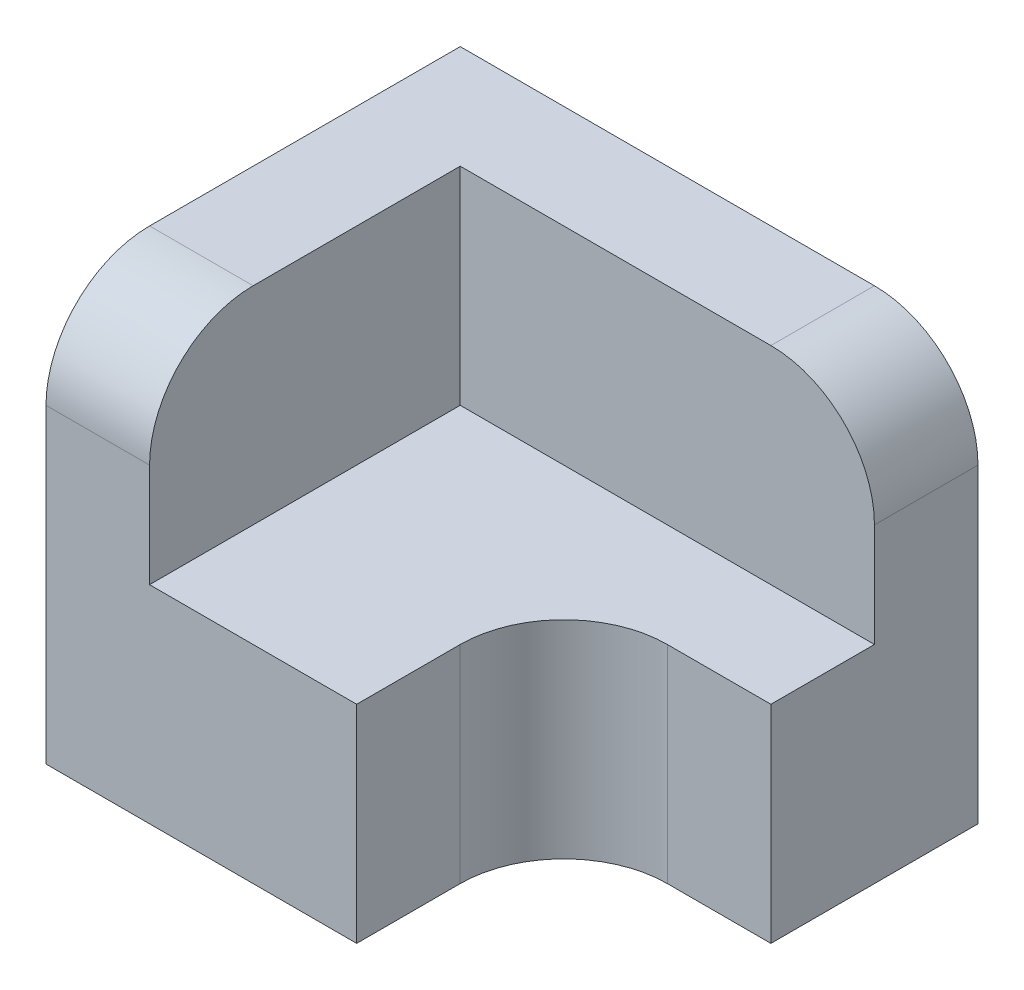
ISO-10303-21;
HEADER;
FILE_DESCRIPTION(('STEP AP214'),'2;1');
FILE_NAME('part.step','',(''),(''),'','','');
FILE_SCHEMA(('AUTOMOTIVE_DESIGN { 1 0 10303 214 1 1 1 1 }'));
ENDSEC;
DATA;
#1=APPLICATION_CONTEXT('core data for automotive mechanical design processes');
#2=APPLICATION_PROTOCOL_DEFINITION('international standard','automotive_design',2000,#1);
#3=PRODUCT_CONTEXT('',#1,'mechanical');
#4=PRODUCT('Part','Part','',(#3));
#5=PRODUCT_RELATED_PRODUCT_CATEGORY('part','',(#4));
#6=PRODUCT_DEFINITION_FORMATION('','',#4);
#7=PRODUCT_DEFINITION_CONTEXT('part definition',#1,'design');
#8=PRODUCT_DEFINITION('design','',#6,#7);
#9=PRODUCT_DEFINITION_SHAPE('','',#8);
#10=(LENGTH_UNIT() NAMED_UNIT(*) SI_UNIT(.MILLI.,.METRE.));
#11=(NAMED_UNIT(*) PLANE_ANGLE_UNIT() SI_UNIT($,.RADIAN.));
#12=(NAMED_UNIT(*) SI_UNIT($,.STERADIAN.) SOLID_ANGLE_UNIT());
#13=UNCERTAINTY_MEASURE_WITH_UNIT(LENGTH_MEASURE(1.E-05),#10,'distance_accuracy_value','');
#14=(GEOMETRIC_REPRESENTATION_CONTEXT(3) GLOBAL_UNCERTAINTY_ASSIGNED_CONTEXT((#13)) GLOBAL_UNIT_ASSIGNED_CONTEXT((#10,
#11,#12)) REPRESENTATION_CONTEXT('',''));
#15=CARTESIAN_POINT('',(0.,0.,0.));
#16=DIRECTION('',(0.,0.,1.));
#17=DIRECTION('',(1.,0.,0.));
#18=AXIS2_PLACEMENT_3D('',#15,#16,#17);
#19=CARTESIAN_POINT('',(0.,20.,0.));
#20=DIRECTION('',(1.,0.,0.));
#21=DIRECTION('',(0.,0.,-1.));
#22=AXIS2_PLACEMENT_3D('',#19,#20,#21);
#23=PLANE('',#22);
#24=DIRECTION('',(0.,-1.,0.));
#25=VECTOR('',#24,1.);
#26=CARTESIAN_POINT('',(0.,20.,0.));
#27=LINE('',#26,#25);
#28=CARTESIAN_POINT('',(0.,30.,0.));
#29=VERTEX_POINT('',#28);
#30=CARTESIAN_POINT('',(0.,0.,0.));
#31=VERTEX_POINT('',#30);
#32=EDGE_CURVE('E201',#29,#31,#27,.T.);
#33=ORIENTED_EDGE('',*,*,#32,.F.);
#34=CARTESIAN_POINT('',(0.,30.,-10.));
#35=DIRECTION('',(1.,0.,0.));
#36=DIRECTION('',(0.,0.,-1.));
#37=AXIS2_PLACEMENT_3D('',#34,#35,#36);
#38=CIRCLE('',#37,10.);
#39=CARTESIAN_POINT('',(0.,40.,-10.));
#40=VERTEX_POINT('',#39);
#41=EDGE_CURVE('E45',#29,#40,#38,.F.);
#42=ORIENTED_EDGE('',*,*,#41,.T.);
#43=DIRECTION('',(0.,0.,1.));
#44=VECTOR('',#43,1.);
#45=CARTESIAN_POINT('',(0.,40.,-40.));
#46=LINE('',#45,#44);
#47=CARTESIAN_POINT('',(0.,40.,-40.));
#48=VERTEX_POINT('',#47);
#49=EDGE_CURVE('E143',#48,#40,#46,.T.);
#50=ORIENTED_EDGE('',*,*,#49,.F.);
#51=DIRECTION('',(0.,-1.,0.));
#52=VECTOR('',#51,1.);
#53=CARTESIAN_POINT('',(0.,20.,-40.));
#54=LINE('',#53,#52);
#55=CARTESIAN_POINT('',(0.,0.,-40.));
#56=VERTEX_POINT('',#55);
#57=EDGE_CURVE('E224',#48,#56,#54,.T.);
#58=ORIENTED_EDGE('',*,*,#57,.T.);
#59=DIRECTION('',(0.,0.,1.));
#60=VECTOR('',#59,1.);
#61=CARTESIAN_POINT('',(0.,0.,0.));
#62=LINE('',#61,#60);
#63=EDGE_CURVE('E164',#56,#31,#62,.T.);
#64=ORIENTED_EDGE('',*,*,#63,.T.);
#65=EDGE_LOOP('',(#33,#42,#50,#58,#64));
#66=FACE_BOUND('',#65,.T.);
#67=ADVANCED_FACE('F30',(#66),#23,.F.);
#68=CARTESIAN_POINT('',(0.,20.,0.));
#69=DIRECTION('',(0.,0.,-1.));
#70=DIRECTION('',(-1.,0.,0.));
#71=AXIS2_PLACEMENT_3D('',#68,#69,#70);
#72=PLANE('',#71);
#73=DIRECTION('',(0.,-1.,0.));
#74=VECTOR('',#73,1.);
#75=CARTESIAN_POINT('',(10.,40.,0.));
#76=LINE('',#75,#74);
#77=CARTESIAN_POINT('',(10.,30.,0.));
#78=VERTEX_POINT('',#77);
#79=CARTESIAN_POINT('',(10.,20.,0.));
#80=VERTEX_POINT('',#79);
#81=EDGE_CURVE('E137',#78,#80,#76,.T.);
#82=ORIENTED_EDGE('',*,*,#81,.F.);
#83=DIRECTION('',(-1.,0.,0.));
#84=VECTOR('',#83,1.);
#85=CARTESIAN_POINT('',(0.,30.,0.));
#86=LINE('',#85,#84);
#87=EDGE_CURVE('E167',#78,#29,#86,.T.);
#88=ORIENTED_EDGE('',*,*,#87,.T.);
#89=ORIENTED_EDGE('',*,*,#32,.T.);
#90=DIRECTION('',(1.,0.,0.));
#91=VECTOR('',#90,1.);
#92=CARTESIAN_POINT('',(0.,0.,0.));
#93=LINE('',#92,#91);
#94=CARTESIAN_POINT('',(30.,0.,0.));
#95=VERTEX_POINT('',#94);
#96=EDGE_CURVE('E192',#31,#95,#93,.T.);
#97=ORIENTED_EDGE('',*,*,#96,.T.);
#98=DIRECTION('',(0.,-1.,0.));
#99=VECTOR('',#98,1.);
#100=CARTESIAN_POINT('',(30.,20.,0.));
#101=LINE('',#100,#99);
#102=CARTESIAN_POINT('',(30.,20.,0.));
#103=VERTEX_POINT('',#102);
#104=EDGE_CURVE('E191',#103,#95,#101,.T.);
#105=ORIENTED_EDGE('',*,*,#104,.F.);
#106=DIRECTION('',(1.,0.,0.));
#107=VECTOR('',#106,1.);
#108=CARTESIAN_POINT('',(0.,20.,0.));
#109=LINE('',#108,#107);
#110=EDGE_CURVE('E366',#80,#103,#109,.T.);
#111=ORIENTED_EDGE('',*,*,#110,.F.);
#112=EDGE_LOOP('',(#82,#88,#89,#97,#105,#111));
#113=FACE_BOUND('',#112,.T.);
#114=ADVANCED_FACE('F234',(#113),#72,.F.);
#115=CARTESIAN_POINT('',(30.,20.,-20.));
#116=DIRECTION('',(-1.,0.,0.));
#117=DIRECTION('',(0.,0.,1.));
#118=AXIS2_PLACEMENT_3D('',#115,#116,#117);
#119=PLANE('',#118);
#120=DIRECTION('',(0.,0.,-1.));
#121=VECTOR('',#120,1.);
#122=CARTESIAN_POINT('',(30.,0.,-20.));
#123=LINE('',#122,#121);
#124=CARTESIAN_POINT('',(30.,0.,-10.));
#125=VERTEX_POINT('',#124);
#126=EDGE_CURVE('E177',#95,#125,#123,.T.);
#127=ORIENTED_EDGE('',*,*,#126,.T.);
#128=DIRECTION('',(0.,-1.,0.));
#129=VECTOR('',#128,1.);
#130=CARTESIAN_POINT('',(30.,20.,-10.));
#131=LINE('',#130,#129);
#132=CARTESIAN_POINT('',(30.,20.,-10.));
#133=VERTEX_POINT('',#132);
#134=EDGE_CURVE('E188',#125,#133,#131,.F.);
#135=ORIENTED_EDGE('',*,*,#134,.T.);
#136=DIRECTION('',(0.,0.,-1.));
#137=VECTOR('',#136,1.);
#138=CARTESIAN_POINT('',(30.,20.,-20.));
#139=LINE('',#138,#137);
#140=EDGE_CURVE('E364',#103,#133,#139,.T.);
#141=ORIENTED_EDGE('',*,*,#140,.F.);
#142=ORIENTED_EDGE('',*,*,#104,.T.);
#143=EDGE_LOOP('',(#127,#135,#141,#142));
#144=FACE_BOUND('',#143,.T.);
#145=ADVANCED_FACE('F186',(#144),#119,.F.);
#146=CARTESIAN_POINT('',(50.,20.,-20.));
#147=DIRECTION('',(0.,0.,-1.));
#148=DIRECTION('',(-1.,0.,0.));
#149=AXIS2_PLACEMENT_3D('',#146,#147,#148);
#150=PLANE('',#149);
#151=DIRECTION('',(1.,0.,0.));
#152=VECTOR('',#151,1.);
#153=CARTESIAN_POINT('',(50.,20.,-20.));
#154=LINE('',#153,#152);
#155=CARTESIAN_POINT('',(40.,20.,-20.));
#156=VERTEX_POINT('',#155);
#157=CARTESIAN_POINT('',(50.,20.,-20.));
#158=VERTEX_POINT('',#157);
#159=EDGE_CURVE('E360',#156,#158,#154,.T.);
#160=ORIENTED_EDGE('',*,*,#159,.F.);
#161=DIRECTION('',(0.,-1.,0.));
#162=VECTOR('',#161,1.);
#163=CARTESIAN_POINT('',(40.,0.,-20.));
#164=LINE('',#163,#162);
#165=CARTESIAN_POINT('',(40.,0.,-20.));
#166=VERTEX_POINT('',#165);
#167=EDGE_CURVE('E197',#156,#166,#164,.T.);
#168=ORIENTED_EDGE('',*,*,#167,.T.);
#169=DIRECTION('',(1.,0.,0.));
#170=VECTOR('',#169,1.);
#171=CARTESIAN_POINT('',(50.,0.,-20.));
#172=LINE('',#171,#170);
#173=CARTESIAN_POINT('',(50.,0.,-20.));
#174=VERTEX_POINT('',#173);
#175=EDGE_CURVE('E179',#166,#174,#172,.T.);
#176=ORIENTED_EDGE('',*,*,#175,.T.);
#177=DIRECTION('',(0.,-1.,0.));
#178=VECTOR('',#177,1.);
#179=CARTESIAN_POINT('',(50.,20.,-20.));
#180=LINE('',#179,#178);
#181=EDGE_CURVE('E223',#158,#174,#180,.T.);
#182=ORIENTED_EDGE('',*,*,#181,.F.);
#183=EDGE_LOOP('',(#160,#168,#176,#182));
#184=FACE_BOUND('',#183,.T.);
#185=ADVANCED_FACE('F246',(#184),#150,.F.);
#186=CARTESIAN_POINT('',(50.,20.,-20.));
#187=DIRECTION('',(-1.,0.,0.));
#188=DIRECTION('',(0.,0.,1.));
#189=AXIS2_PLACEMENT_3D('',#186,#187,#188);
#190=PLANE('',#189);
#191=DIRECTION('',(0.,-1.,0.));
#192=VECTOR('',#191,1.);
#193=CARTESIAN_POINT('',(50.,20.,-40.));
#194=LINE('',#193,#192);
#195=CARTESIAN_POINT('',(50.,30.,-40.));
#196=VERTEX_POINT('',#195);
#197=CARTESIAN_POINT('',(50.,0.,-40.));
#198=VERTEX_POINT('',#197);
#199=EDGE_CURVE('E213',#196,#198,#194,.T.);
#200=ORIENTED_EDGE('',*,*,#199,.F.);
#201=DIRECTION('',(0.,0.,1.));
#202=VECTOR('',#201,1.);
#203=CARTESIAN_POINT('',(50.,30.,-20.));
#204=LINE('',#203,#202);
#205=CARTESIAN_POINT('',(50.,30.,-30.));
#206=VERTEX_POINT('',#205);
#207=EDGE_CURVE('E196',#196,#206,#204,.T.);
#208=ORIENTED_EDGE('',*,*,#207,.T.);
#209=DIRECTION('',(0.,-1.,0.));
#210=VECTOR('',#209,1.);
#211=CARTESIAN_POINT('',(50.,40.,-30.));
#212=LINE('',#211,#210);
#213=CARTESIAN_POINT('',(50.,20.,-30.));
#214=VERTEX_POINT('',#213);
#215=EDGE_CURVE('E138',#206,#214,#212,.T.);
#216=ORIENTED_EDGE('',*,*,#215,.T.);
#217=DIRECTION('',(0.,0.,-1.));
#218=VECTOR('',#217,1.);
#219=CARTESIAN_POINT('',(50.,20.,-20.));
#220=LINE('',#219,#218);
#221=EDGE_CURVE('E154',#158,#214,#220,.T.);
#222=ORIENTED_EDGE('',*,*,#221,.F.);
#223=ORIENTED_EDGE('',*,*,#181,.T.);
#224=DIRECTION('',(0.,0.,-1.));
#225=VECTOR('',#224,1.);
#226=CARTESIAN_POINT('',(50.,0.,-20.));
#227=LINE('',#226,#225);
#228=EDGE_CURVE('E221',#174,#198,#227,.T.);
#229=ORIENTED_EDGE('',*,*,#228,.T.);
#230=EDGE_LOOP('',(#200,#208,#216,#222,#223,#229));
#231=FACE_BOUND('',#230,.T.);
#232=ADVANCED_FACE('F219',(#231),#190,.F.);
#233=CARTESIAN_POINT('',(0.,20.,-40.));
#234=DIRECTION('',(0.,0.,1.));
#235=DIRECTION('',(1.,0.,0.));
#236=AXIS2_PLACEMENT_3D('',#233,#234,#235);
#237=PLANE('',#236);
#238=DIRECTION('',(-1.,0.,0.));
#239=VECTOR('',#238,1.);
#240=CARTESIAN_POINT('',(50.,40.,-40.));
#241=LINE('',#240,#239);
#242=CARTESIAN_POINT('',(40.,40.,-40.));
#243=VERTEX_POINT('',#242);
#244=EDGE_CURVE('E130',#243,#48,#241,.T.);
#245=ORIENTED_EDGE('',*,*,#244,.F.);
#246=CARTESIAN_POINT('',(40.,30.,-40.));
#247=DIRECTION('',(0.,0.,1.));
#248=DIRECTION('',(1.,0.,0.));
#249=AXIS2_PLACEMENT_3D('',#246,#247,#248);
#250=CIRCLE('',#249,10.);
#251=EDGE_CURVE('E165',#243,#196,#250,.F.);
#252=ORIENTED_EDGE('',*,*,#251,.T.);
#253=ORIENTED_EDGE('',*,*,#199,.T.);
#254=DIRECTION('',(-1.,0.,0.));
#255=VECTOR('',#254,1.);
#256=CARTESIAN_POINT('',(0.,0.,-40.));
#257=LINE('',#256,#255);
#258=EDGE_CURVE('E375',#198,#56,#257,.T.);
#259=ORIENTED_EDGE('',*,*,#258,.T.);
#260=ORIENTED_EDGE('',*,*,#57,.F.);
#261=EDGE_LOOP('',(#245,#252,#253,#259,#260));
#262=FACE_BOUND('',#261,.T.);
#263=ADVANCED_FACE('F212',(#262),#237,.F.);
#264=CARTESIAN_POINT('',(0.,20.,-40.));
#265=DIRECTION('',(0.,-1.,0.));
#266=DIRECTION('',(0.,0.,-1.));
#267=AXIS2_PLACEMENT_3D('',#264,#265,#266);
#268=PLANE('',#267);
#269=ORIENTED_EDGE('',*,*,#221,.T.);
#270=DIRECTION('',(1.,0.,0.));
#271=VECTOR('',#270,1.);
#272=CARTESIAN_POINT('',(50.,20.,-30.));
#273=LINE('',#272,#271);
#274=CARTESIAN_POINT('',(10.,20.,-30.));
#275=VERTEX_POINT('',#274);
#276=EDGE_CURVE('E145',#214,#275,#273,.F.);
#277=ORIENTED_EDGE('',*,*,#276,.T.);
#278=DIRECTION('',(0.,0.,-1.));
#279=VECTOR('',#278,1.);
#280=CARTESIAN_POINT('',(10.,20.,-40.));
#281=LINE('',#280,#279);
#282=EDGE_CURVE('E135',#275,#80,#281,.F.);
#283=ORIENTED_EDGE('',*,*,#282,.T.);
#284=ORIENTED_EDGE('',*,*,#110,.T.);
#285=ORIENTED_EDGE('',*,*,#140,.T.);
#286=CARTESIAN_POINT('',(40.,20.,-10.));
#287=DIRECTION('',(0.,-1.,0.));
#288=DIRECTION('',(0.,0.,-1.));
#289=AXIS2_PLACEMENT_3D('',#286,#287,#288);
#290=CIRCLE('',#289,10.);
#291=EDGE_CURVE('E11',#133,#156,#290,.T.);
#292=ORIENTED_EDGE('',*,*,#291,.T.);
#293=ORIENTED_EDGE('',*,*,#159,.T.);
#294=EDGE_LOOP('',(#269,#277,#283,#284,#285,#292,#293));
#295=FACE_BOUND('',#294,.T.);
#296=ADVANCED_FACE('F254',(#295),#268,.F.);
#297=CARTESIAN_POINT('',(0.,0.,-40.));
#298=DIRECTION('',(0.,-1.,0.));
#299=DIRECTION('',(0.,0.,-1.));
#300=AXIS2_PLACEMENT_3D('',#297,#298,#299);
#301=PLANE('',#300);
#302=ORIENTED_EDGE('',*,*,#63,.F.);
#303=ORIENTED_EDGE('',*,*,#258,.F.);
#304=ORIENTED_EDGE('',*,*,#228,.F.);
#305=ORIENTED_EDGE('',*,*,#175,.F.);
#306=CARTESIAN_POINT('',(40.,0.,-10.));
#307=DIRECTION('',(0.,-1.,0.));
#308=DIRECTION('',(0.,0.,-1.));
#309=AXIS2_PLACEMENT_3D('',#306,#307,#308);
#310=CIRCLE('',#309,10.);
#311=EDGE_CURVE('E38',#166,#125,#310,.F.);
#312=ORIENTED_EDGE('',*,*,#311,.T.);
#313=ORIENTED_EDGE('',*,*,#126,.F.);
#314=ORIENTED_EDGE('',*,*,#96,.F.);
#315=EDGE_LOOP('',(#302,#303,#304,#305,#312,#313,#314));
#316=FACE_BOUND('',#315,.T.);
#317=ADVANCED_FACE('F175',(#316),#301,.T.);
#318=CARTESIAN_POINT('',(10.,40.,-40.));
#319=DIRECTION('',(1.,0.,0.));
#320=DIRECTION('',(0.,0.,-1.));
#321=AXIS2_PLACEMENT_3D('',#318,#319,#320);
#322=PLANE('',#321);
#323=DIRECTION('',(0.,0.,-1.));
#324=VECTOR('',#323,1.);
#325=CARTESIAN_POINT('',(10.,40.,-40.));
#326=LINE('',#325,#324);
#327=CARTESIAN_POINT('',(10.,40.,-30.));
#328=VERTEX_POINT('',#327);
#329=CARTESIAN_POINT('',(10.,40.,-10.));
#330=VERTEX_POINT('',#329);
#331=EDGE_CURVE('E131',#328,#330,#326,.F.);
#332=ORIENTED_EDGE('',*,*,#331,.T.);
#333=CARTESIAN_POINT('',(10.,30.,-10.));
#334=DIRECTION('',(1.,0.,0.));
#335=DIRECTION('',(0.,0.,-1.));
#336=AXIS2_PLACEMENT_3D('',#333,#334,#335);
#337=CIRCLE('',#336,10.);
#338=EDGE_CURVE('E53',#330,#78,#337,.T.);
#339=ORIENTED_EDGE('',*,*,#338,.T.);
#340=ORIENTED_EDGE('',*,*,#81,.T.);
#341=ORIENTED_EDGE('',*,*,#282,.F.);
#342=DIRECTION('',(0.,-1.,0.));
#343=VECTOR('',#342,1.);
#344=CARTESIAN_POINT('',(10.,40.,-30.));
#345=LINE('',#344,#343);
#346=EDGE_CURVE('E124',#328,#275,#345,.T.);
#347=ORIENTED_EDGE('',*,*,#346,.F.);
#348=EDGE_LOOP('',(#332,#339,#340,#341,#347));
#349=FACE_BOUND('',#348,.T.);
#350=ADVANCED_FACE('F133',(#349),#322,.T.);
#351=CARTESIAN_POINT('',(50.,40.,-30.));
#352=DIRECTION('',(0.,0.,1.));
#353=DIRECTION('',(1.,0.,0.));
#354=AXIS2_PLACEMENT_3D('',#351,#352,#353);
#355=PLANE('',#354);
#356=ORIENTED_EDGE('',*,*,#215,.F.);
#357=CARTESIAN_POINT('',(40.,30.,-30.));
#358=DIRECTION('',(0.,0.,1.));
#359=DIRECTION('',(1.,0.,0.));
#360=AXIS2_PLACEMENT_3D('',#357,#358,#359);
#361=CIRCLE('',#360,10.);
#362=CARTESIAN_POINT('',(40.,40.,-30.));
#363=VERTEX_POINT('',#362);
#364=EDGE_CURVE('E126',#206,#363,#361,.T.);
#365=ORIENTED_EDGE('',*,*,#364,.T.);
#366=DIRECTION('',(1.,0.,0.));
#367=VECTOR('',#366,1.);
#368=CARTESIAN_POINT('',(50.,40.,-30.));
#369=LINE('',#368,#367);
#370=EDGE_CURVE('E119',#363,#328,#369,.F.);
#371=ORIENTED_EDGE('',*,*,#370,.T.);
#372=ORIENTED_EDGE('',*,*,#346,.T.);
#373=ORIENTED_EDGE('',*,*,#276,.F.);
#374=EDGE_LOOP('',(#356,#365,#371,#372,#373));
#375=FACE_BOUND('',#374,.T.);
#376=ADVANCED_FACE('F122',(#375),#355,.T.);
#377=CARTESIAN_POINT('',(0.,40.,0.));
#378=DIRECTION('',(0.,-1.,0.));
#379=DIRECTION('',(0.,0.,-1.));
#380=AXIS2_PLACEMENT_3D('',#377,#378,#379);
#381=PLANE('',#380);
#382=ORIENTED_EDGE('',*,*,#370,.F.);
#383=DIRECTION('',(0.,0.,1.));
#384=VECTOR('',#383,1.);
#385=CARTESIAN_POINT('',(40.,40.,0.));
#386=LINE('',#385,#384);
#387=EDGE_CURVE('E207',#363,#243,#386,.F.);
#388=ORIENTED_EDGE('',*,*,#387,.T.);
#389=ORIENTED_EDGE('',*,*,#244,.T.);
#390=ORIENTED_EDGE('',*,*,#49,.T.);
#391=DIRECTION('',(-1.,0.,0.));
#392=VECTOR('',#391,1.);
#393=CARTESIAN_POINT('',(0.,40.,-10.));
#394=LINE('',#393,#392);
#395=EDGE_CURVE('E142',#40,#330,#394,.F.);
#396=ORIENTED_EDGE('',*,*,#395,.T.);
#397=ORIENTED_EDGE('',*,*,#331,.F.);
#398=EDGE_LOOP('',(#382,#388,#389,#390,#396,#397));
#399=FACE_BOUND('',#398,.T.);
#400=ADVANCED_FACE('F140',(#399),#381,.F.);
#401=CARTESIAN_POINT('',(40.,20.,-10.));
#402=DIRECTION('',(0.,1.,0.));
#403=DIRECTION('',(0.,0.,1.));
#404=AXIS2_PLACEMENT_3D('',#401,#402,#403);
#405=CYLINDRICAL_SURFACE('',#404,10.);
#406=ORIENTED_EDGE('',*,*,#291,.F.);
#407=ORIENTED_EDGE('',*,*,#134,.F.);
#408=ORIENTED_EDGE('',*,*,#311,.F.);
#409=ORIENTED_EDGE('',*,*,#167,.F.);
#410=EDGE_LOOP('',(#406,#407,#408,#409));
#411=FACE_BOUND('',#410,.T.);
#412=ADVANCED_FACE('F195',(#411),#405,.F.);
#413=CARTESIAN_POINT('',(40.,30.,-20.));
#414=DIRECTION('',(0.,0.,1.));
#415=DIRECTION('',(1.,0.,0.));
#416=AXIS2_PLACEMENT_3D('',#413,#414,#415);
#417=CYLINDRICAL_SURFACE('',#416,10.);
#418=ORIENTED_EDGE('',*,*,#251,.F.);
#419=ORIENTED_EDGE('',*,*,#387,.F.);
#420=ORIENTED_EDGE('',*,*,#364,.F.);
#421=ORIENTED_EDGE('',*,*,#207,.F.);
#422=EDGE_LOOP('',(#418,#419,#420,#421));
#423=FACE_BOUND('',#422,.T.);
#424=ADVANCED_FACE('F226',(#423),#417,.T.);
#425=CARTESIAN_POINT('',(0.,30.,-10.));
#426=DIRECTION('',(-1.,0.,0.));
#427=DIRECTION('',(0.,0.,1.));
#428=AXIS2_PLACEMENT_3D('',#425,#426,#427);
#429=CYLINDRICAL_SURFACE('',#428,10.);
#430=ORIENTED_EDGE('',*,*,#338,.F.);
#431=ORIENTED_EDGE('',*,*,#395,.F.);
#432=ORIENTED_EDGE('',*,*,#41,.F.);
#433=ORIENTED_EDGE('',*,*,#87,.F.);
#434=EDGE_LOOP('',(#430,#431,#432,#433));
#435=FACE_BOUND('',#434,.T.);
#436=ADVANCED_FACE('F32',(#435),#429,.T.);
#437=CLOSED_SHELL('',(#67,#114,#145,#185,#232,#263,#296,#317,#350,#376,#400,#412,#424,#436));
#438=MANIFOLD_SOLID_BREP('B2',#437);
#439=ADVANCED_BREP_SHAPE_REPRESENTATION('',(#18,#438),#14);
#440=SHAPE_DEFINITION_REPRESENTATION(#9,#439);
ENDSEC;
END-ISO-10303-21;
